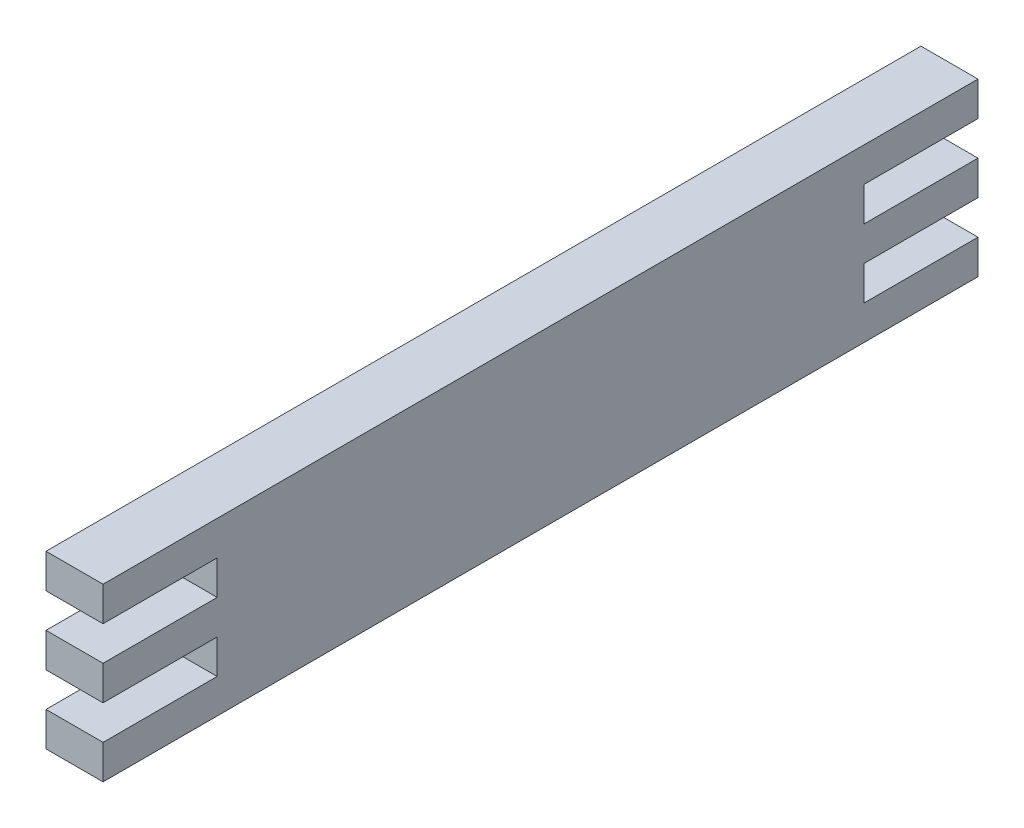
from build123d import *

# Parameters (mm, degrees)
SKETCH1_W           = 46
SKETCH1_H           = 9
BOSS_EXTRUDE1_DEPTH = 3
SKETCH2_W           = 6
SKETCH2_H           = 1.8
CUT_EXTRUDE1_DEPTH  = 10


with BuildPart() as part:
    # Sketch1 → Boss-Extrude1 (new body)
    with BuildSketch(Plane(origin=(0, 0, 0), x_dir=(0, 0, -1), z_dir=(1, 0, 0))):
        Rectangle(SKETCH1_W, SKETCH1_H)
    extrude(amount=BOSS_EXTRUDE1_DEPTH)

    # Sketch2 → Cut-Extrude1 (cut)
    with BuildSketch(Plane(origin=(3, 0, 0), x_dir=(0, 0, -1), z_dir=(1, 0, 0))):
        with Locations((-20, 1.8)):
            Rectangle(SKETCH2_W, SKETCH2_H)
        with Locations((-20, -1.8)):
            Rectangle(SKETCH2_W, SKETCH2_H)
        with Locations((20, -1.8)):
            Rectangle(SKETCH2_W, SKETCH2_H)
        with Locations((20, 1.8)):
            Rectangle(SKETCH2_W, SKETCH2_H)
    extrude(amount=-CUT_EXTRUDE1_DEPTH, mode=Mode.SUBTRACT)


solid = part.part
